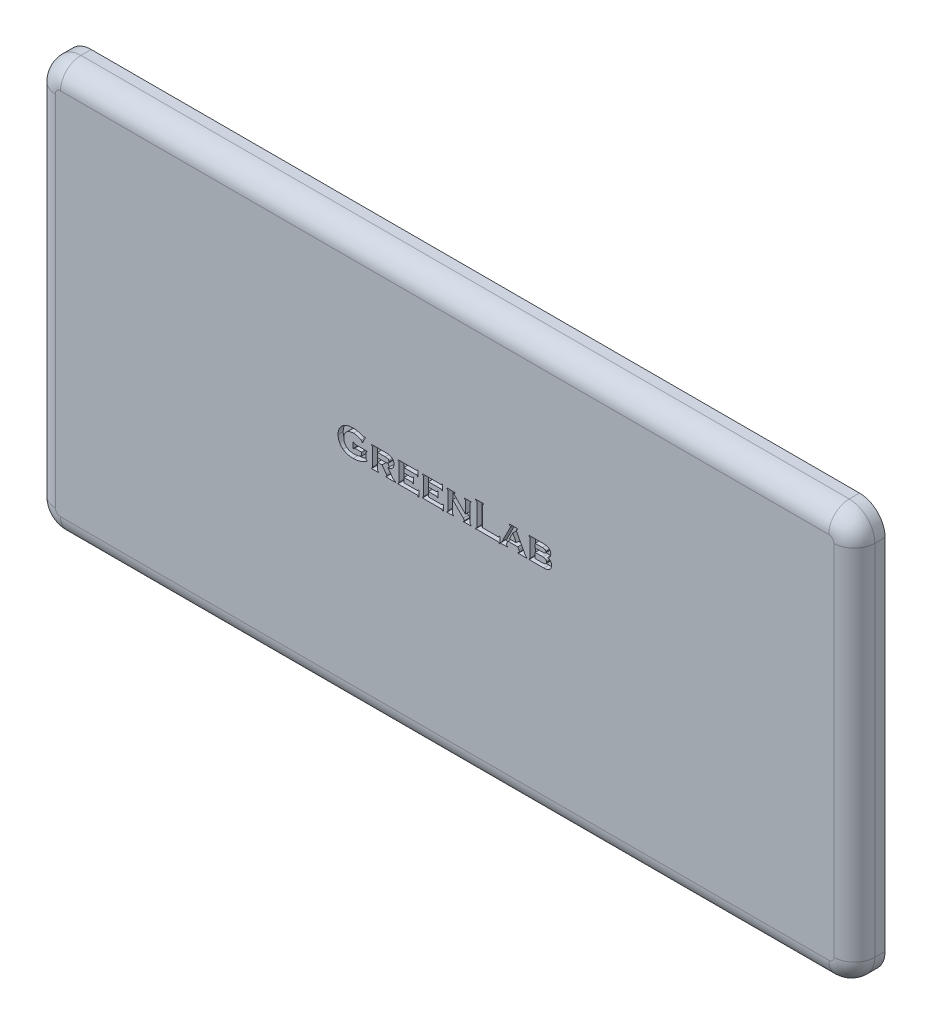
from build123d import *

# Parameters (mm, degrees)
SKETCH1_W           = 80
SKETCH1_H           = 40
BOSS_EXTRUDE1_DEPTH = 3
FILLET1_R           = 2.5
FILLET2_R           = 2
CUT_EXTRUDE1_DEPTH  = 0.5


with BuildPart() as part:
    # Sketch1 → Boss-Extrude1 (new body)
    with BuildSketch(Plane.XY.offset(3)):
        with Locations((17.5, -2.5)):
            Rectangle(SKETCH1_W, SKETCH1_H)
    extrude(amount=-BOSS_EXTRUDE1_DEPTH)

    # Fillet1
    fillet1_edges = [part.edges().sort_by_distance(p)[0] for p in [
        (-22.5, -22.5, 1.5),
        (-22.5, 17.5, 1.5),
        (57.5, 17.5, 1.5),
        (57.5, -22.5, 1.5),
    ]]
    fillet(fillet1_edges, radius=FILLET1_R)

    # Fillet2
    fillet2_edges = [part.edges().sort_by_distance(p)[0] for p in [
        (17.5, 17.5, 3),
        (17.5, -22.5, 3),
        (57.5, -2.5, 3),
        (-22.5, -2.5, 3),
        (56.767766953, -21.767766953, 3),
        (-21.767766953, -21.767766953, 3),
        (56.767766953, 16.767766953, 3),
        (-21.767766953, 16.767766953, 3),
    ]]
    fillet(fillet2_edges, radius=FILLET2_R)

    # Sketch2 → Cut-Extrude1 (cut)
    # profile 1 of 8: a face of its own
    with BuildSketch(Plane.XY.offset(3)):
        with BuildLine():
            Line((9.392361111, -0.347222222), (8.763020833, -0.347222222))
            add(Edge.make_bspline(
                [(8.763020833, -0.347222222), (8.753980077, -0.347634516), (8.736897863, -0.34841353), (8.712652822, -0.35149615), (8.692508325, -0.359463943), (8.675040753, -0.369292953), (8.661109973, -0.38393915), (8.648530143, -0.402230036), (8.637222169, -0.425071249), (8.63150657, -0.442262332), (8.628472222, -0.451388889)],
                knots=[0, 0, 0, 0, 1.161951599, 2.195469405, 3.113157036, 3.92473158, 4.744880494, 5.677977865, 6.767264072, 8, 8, 8, 8], degree=3))
            Line((8.628472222, -0.451388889), (8.559027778, -0.451388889))
            Line((8.559027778, -0.451388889), (8.559027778, 0.104166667))
            Line((8.559027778, 0.104166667), (8.628472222, 0.104166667))
            add(Edge.make_bspline(
                [(8.628472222, 0.104166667), (8.631455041, 0.094831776), (8.63702767, 0.077391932), (8.648829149, 0.054602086), (8.66035132, 0.03555398), (8.674333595, 0.021148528), (8.691430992, 0.011661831), (8.711127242, 0.00441836), (8.734709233, 0.001141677), (8.75144255, 0.000395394), (8.76030816, 0)],
                knots=[0, 0, 0, 0, 1.267174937, 2.367390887, 3.316236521, 4.144614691, 4.932227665, 5.829021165, 6.8497767, 8, 8, 8, 8], degree=3))
            Line((8.76030816, 0), (9.947916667, 0))
            Line((9.947916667, 0), (9.947916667, -0.069444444))
            add(Edge.make_bspline(
                [(9.947916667, -0.069444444), (9.938958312, -0.072276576), (9.922120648, -0.077599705), (9.899742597, -0.088767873), (9.881037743, -0.100221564), (9.866701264, -0.113946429), (9.855806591, -0.129700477), (9.849088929, -0.14859326), (9.844582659, -0.170325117), (9.844040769, -0.185880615), (9.84375, -0.194227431)],
                knots=[0, 0, 0, 0, 1.261989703, 2.371971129, 3.357346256, 4.200586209, 5.023932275, 5.909634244, 6.878345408, 8, 8, 8, 8], degree=3))
            Line((9.84375, -0.194227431), (9.84375, -0.673828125))
            add(Edge.make_bspline(
                [(9.84375, -0.673828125), (9.844110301, -0.682161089), (9.844780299, -0.697656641), (9.848455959, -0.719691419), (9.855267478, -0.738581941), (9.865562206, -0.754788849), (9.879855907, -0.76839035), (9.898945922, -0.779314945), (9.921581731, -0.790471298), (9.938775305, -0.795785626), (9.947916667, -0.798611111)],
                knots=[0, 0, 0, 0, 1.116533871, 2.076248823, 2.980572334, 3.786808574, 4.626198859, 5.59413096, 6.720864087, 8, 8, 8, 8], degree=3))
            Line((9.947916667, -0.798611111), (9.947916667, -0.868055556))
            add(Edge.make_bspline(
                [(9.947916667, -0.868055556), (9.889333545, -0.901306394), (9.774179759, -0.966665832), (9.597911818, -1.051148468), (9.4231664, -1.123083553), (9.249782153, -1.181933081), (9.077820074, -1.22792273), (8.907208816, -1.26040836), (8.737842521, -1.280912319), (8.625273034, -1.283457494), (8.569335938, -1.284722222)],
                knots=[0, 0, 0, 0, 1.109239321, 2.180373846, 3.216973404, 4.220153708, 5.194106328, 6.146335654, 7.078892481, 8, 8, 8, 8], degree=3))
            add(Edge.make_bspline(
                [(8.569335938, -1.284722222), (8.519929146, -1.283992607), (8.423451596, -1.282567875), (8.282287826, -1.26841923), (8.147967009, -1.246781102), (8.020801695, -1.214926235), (7.899922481, -1.175751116), (7.786620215, -1.12610841), (7.679736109, -1.068197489), (7.614070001, -1.022231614), (7.581380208, -0.999348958)],
                knots=[0, 0, 0, 0, 1.133031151, 2.212490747, 3.251195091, 4.25132316, 5.216867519, 6.162529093, 7.085273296, 8, 8, 8, 8], degree=3))
            add(Edge.make_bspline(
                [(7.581380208, -0.999348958), (7.561875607, -0.984168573), (7.523156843, -0.954033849), (7.468372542, -0.905928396), (7.417838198, -0.855026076), (7.370449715, -0.802718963), (7.32740661, -0.747401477), (7.288026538, -0.690094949), (7.251828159, -0.630940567), (7.220575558, -0.569179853), (7.19202152, -0.505624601), (7.167821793, -0.439559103), (7.147270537, -0.371389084), (7.129525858, -0.301271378), (7.116815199, -0.228693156), (7.107739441, -0.153891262), (7.101320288, -0.077151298), (7.100904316, -0.025150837), (7.100694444, 0.001085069)],
                knots=[0, 0, 0, 0, 1.027594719, 2.039887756, 3.02889878, 4.008719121, 4.97294883, 5.940778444, 6.898978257, 7.854104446, 8.816896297, 9.794723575, 10.777166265, 11.776613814, 12.800294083, 13.838400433, 14.909403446, 16, 16, 16, 16], degree=3))
            add(Edge.make_bspline(
                [(7.100694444, 0.001085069), (7.101836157, 0.049624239), (7.104066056, 0.144426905), (7.124688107, 0.2828534), (7.158277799, 0.41361329), (7.204809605, 0.537141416), (7.265875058, 0.652470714), (7.339325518, 0.760529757), (7.426804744, 0.860943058), (7.494039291, 0.919974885), (7.528211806, 0.949978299)],
                knots=[0, 0, 0, 0, 1.080618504, 2.110574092, 3.109061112, 4.08310081, 5.043468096, 6.008781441, 6.987946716, 8, 8, 8, 8], degree=3))
            add(Edge.make_bspline(
                [(7.528211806, 0.949978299), (7.562730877, 0.977010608), (7.632080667, 1.031319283), (7.747213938, 1.098570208), (7.869864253, 1.156516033), (8.001041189, 1.203687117), (8.140572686, 1.239848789), (8.288247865, 1.265688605), (8.444201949, 1.281667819), (8.551031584, 1.28368846), (8.605685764, 1.284722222)],
                knots=[0, 0, 0, 0, 0.913103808, 1.834451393, 2.772129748, 3.738097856, 4.735733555, 5.773315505, 6.860825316, 8, 8, 8, 8], degree=3))
            add(Edge.make_bspline(
                [(8.605685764, 1.284722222), (8.640778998, 1.284112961), (8.709950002, 1.282912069), (8.812133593, 1.276048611), (8.911161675, 1.263397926), (9.008994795, 1.245834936), (9.108495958, 1.221898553), (9.213103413, 1.191809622), (9.324018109, 1.154967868), (9.399514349, 1.126398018), (9.438476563, 1.111653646)],
                knots=[0, 0, 0, 0, 0.983904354, 1.939338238, 2.869415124, 3.781350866, 4.72455948, 5.737149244, 6.832184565, 8, 8, 8, 8], degree=3))
            add(Edge.make_bspline(
                [(9.438476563, 1.111653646), (9.457578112, 1.104222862), (9.492621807, 1.090590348), (9.541236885, 1.074748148), (9.581117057, 1.064487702), (9.604995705, 1.062571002), (9.615342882, 1.061740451)],
                knots=[0, 0, 0, 0, 1.33242011, 2.444457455, 3.325947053, 4, 4, 4, 4], degree=3))
            add(Edge.make_bspline(
                [(9.615342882, 1.061740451), (9.62210386, 1.062329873), (9.636600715, 1.063593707), (9.658314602, 1.072586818), (9.681605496, 1.085933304), (9.696688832, 1.097688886), (9.704861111, 1.10405816)],
                knots=[0, 0, 0, 0, 0.80452628, 1.72506123, 2.767418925, 4, 4, 4, 4], degree=3))
            Line((9.704861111, 1.10405816), (9.774305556, 1.076388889))
            Line((9.774305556, 1.076388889), (9.479166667, 0.477430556))
            Line((9.479166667, 0.477430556), (9.425998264, 0.505642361))
            add(Edge.make_bspline(
                [(9.425998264, 0.505642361), (9.425696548, 0.515250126), (9.425141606, 0.53292155), (9.420973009, 0.557160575), (9.416515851, 0.577292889), (9.409832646, 0.594498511), (9.398649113, 0.609467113), (9.384749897, 0.625852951), (9.365336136, 0.64292875), (9.350816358, 0.654545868), (9.342990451, 0.660807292)],
                knots=[0, 0, 0, 0, 1.244331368, 2.288680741, 3.181265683, 3.916936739, 4.658188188, 5.588746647, 6.700376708, 8, 8, 8, 8], degree=3))
            add(Edge.make_bspline(
                [(9.342990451, 0.660807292), (9.322295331, 0.675012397), (9.278307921, 0.705205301), (9.201774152, 0.743529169), (9.112004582, 0.777376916), (9.012385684, 0.808613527), (8.907875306, 0.834707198), (8.803510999, 0.853755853), (8.70199497, 0.865740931), (8.635194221, 0.867293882), (8.602430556, 0.868055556)],
                knots=[0, 0, 0, 0, 0.772448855, 1.64183753, 2.627606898, 3.725128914, 4.855858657, 5.942928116, 6.991070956, 8, 8, 8, 8], degree=3))
            add(Edge.make_bspline(
                [(8.602430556, 0.868055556), (8.570210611, 0.867506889), (8.507224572, 0.866434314), (8.414688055, 0.855766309), (8.326500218, 0.838592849), (8.242201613, 0.814661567), (8.162425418, 0.783836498), (8.086855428, 0.7458094), (8.014859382, 0.701918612), (7.971099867, 0.666554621), (7.94921875, 0.648871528)],
                knots=[0, 0, 0, 0, 1.098368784, 2.14717621, 3.171603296, 4.15934231, 5.131674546, 6.083189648, 7.041535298, 8, 8, 8, 8], degree=3))
            add(Edge.make_bspline(
                [(7.94921875, 0.648871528), (7.925714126, 0.62788857), (7.879504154, 0.58663618), (7.820080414, 0.516055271), (7.769439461, 0.441157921), (7.727678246, 0.361166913), (7.695598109, 0.276060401), (7.67312424, 0.185921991), (7.658299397, 0.09109294), (7.656942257, 0.026099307), (7.65625, -0.007052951)],
                knots=[0, 0, 0, 0, 1.016795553, 1.999014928, 2.971244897, 3.932867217, 4.907271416, 5.901990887, 6.92983762, 8, 8, 8, 8], degree=3))
            add(Edge.make_bspline(
                [(7.65625, -0.007052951), (7.656972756, -0.039300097), (7.65838448, -0.102286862), (7.672712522, -0.194381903), (7.694337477, -0.281931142), (7.726437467, -0.364534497), (7.766391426, -0.442507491), (7.816216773, -0.515299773), (7.87386815, -0.584302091), (7.919197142, -0.624636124), (7.942165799, -0.645073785)],
                knots=[0, 0, 0, 0, 1.069643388, 2.089281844, 3.086639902, 4.057689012, 5.02427436, 5.988321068, 6.980662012, 8, 8, 8, 8], degree=3))
            add(Edge.make_bspline(
                [(7.942165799, -0.645073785), (7.964434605, -0.66289434), (8.009168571, -0.698692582), (8.082803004, -0.744305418), (8.161999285, -0.782097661), (8.245783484, -0.813760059), (8.33478101, -0.838245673), (8.429033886, -0.855186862), (8.528366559, -0.866595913), (8.596429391, -0.867562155), (8.631184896, -0.868055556)],
                knots=[0, 0, 0, 0, 0.924808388, 1.857771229, 2.80254234, 3.768129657, 4.760342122, 5.792672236, 6.872853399, 8, 8, 8, 8], degree=3))
            add(Edge.make_bspline(
                [(8.631184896, -0.868055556), (8.665740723, -0.867328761), (8.734776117, -0.865876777), (8.838102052, -0.857261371), (8.940531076, -0.841751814), (9.041488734, -0.821473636), (9.138598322, -0.795732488), (9.230099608, -0.765568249), (9.314450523, -0.730503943), (9.366864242, -0.702960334), (9.392361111, -0.689561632)],
                knots=[0, 0, 0, 0, 1.05048524, 2.098652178, 3.148964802, 4.19795309, 5.227341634, 6.200829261, 7.124785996, 8, 8, 8, 8], degree=3))
            Line((9.392361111, -0.689561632), (9.392361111, -0.347222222))
        make_face()
    # profile 2 of 8: a face of its own
    with BuildSketch(Plane.XY.offset(3)):
        with BuildLine():
            Line((10.954861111, -0.416666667), (10.954861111, -1.048177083))
            add(Edge.make_bspline(
                [(10.954861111, -1.048177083), (10.955160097, -1.0568801), (10.955718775, -1.073142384), (10.960153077, -1.095995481), (10.967061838, -1.115684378), (10.976966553, -1.132897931), (10.991774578, -1.146977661), (11.010052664, -1.159747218), (11.032919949, -1.171315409), (11.049903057, -1.177326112), (11.059027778, -1.180555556)],
                knots=[0, 0, 0, 0, 1.132768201, 2.116668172, 3.018181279, 3.842213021, 4.674950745, 5.655178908, 6.740169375, 8, 8, 8, 8], degree=3))
            Line((11.059027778, -1.180555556), (11.059027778, -1.25))
            Line((11.059027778, -1.25), (10.364583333, -1.25))
            Line((10.364583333, -1.25), (10.364583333, -1.180555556))
            add(Edge.make_bspline(
                [(10.364583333, -1.180555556), (10.373527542, -1.177700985), (10.390338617, -1.172335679), (10.412846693, -1.161465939), (10.431179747, -1.149034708), (10.44552045, -1.134320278), (10.456004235, -1.116821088), (10.463583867, -1.09662627), (10.467845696, -1.073126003), (10.468435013, -1.056513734), (10.46875, -1.047634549)],
                knots=[0, 0, 0, 0, 1.214843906, 2.283358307, 3.225537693, 4.070394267, 4.922042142, 5.848661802, 6.850119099, 8, 8, 8, 8], degree=3))
            Line((10.46875, -1.047634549), (10.46875, 0.59624566))
            add(Edge.make_bspline(
                [(10.46875, 0.59624566), (10.468319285, 0.604919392), (10.467498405, 0.621450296), (10.464620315, 0.64488467), (10.45623523, 0.664293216), (10.44672628, 0.681553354), (10.431864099, 0.6953932), (10.413956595, 0.708696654), (10.390768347, 0.719741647), (10.373681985, 0.725891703), (10.364583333, 0.729166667)],
                knots=[0, 0, 0, 0, 1.128472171, 2.1507081, 3.035212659, 3.856119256, 4.685698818, 5.643135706, 6.74494729, 8, 8, 8, 8], degree=3))
            Line((10.364583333, 0.729166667), (10.364583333, 0.798611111))
            Line((10.364583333, 0.798611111), (11.694878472, 0.798611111))
            add(Edge.make_bspline(
                [(11.694878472, 0.798611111), (11.735571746, 0.798319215), (11.811747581, 0.797772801), (11.918395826, 0.793316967), (12.009437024, 0.784663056), (12.08734479, 0.773630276), (12.155785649, 0.757407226), (12.218709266, 0.736400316), (12.278069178, 0.7097724), (12.314661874, 0.687594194), (12.332899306, 0.676540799)],
                knots=[0, 0, 0, 0, 1.48188809, 2.77402262, 3.885406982, 4.811191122, 5.637019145, 6.442966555, 7.223990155, 8, 8, 8, 8], degree=3))
            add(Edge.make_bspline(
                [(12.332899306, 0.676540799), (12.350487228, 0.664205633), (12.385272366, 0.639809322), (12.430084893, 0.594520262), (12.467690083, 0.543526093), (12.498940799, 0.487256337), (12.522781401, 0.425103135), (12.540108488, 0.357414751), (12.550472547, 0.283885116), (12.551535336, 0.232962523), (12.552083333, 0.206705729)],
                knots=[0, 0, 0, 0, 0.949876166, 1.878651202, 2.806113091, 3.748939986, 4.72015234, 5.745812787, 6.837692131, 8, 8, 8, 8], degree=3))
            add(Edge.make_bspline(
                [(12.552083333, 0.206705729), (12.551684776, 0.186614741), (12.550906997, 0.147407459), (12.544326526, 0.090219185), (12.533431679, 0.036559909), (12.51909248, -0.014020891), (12.499164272, -0.060657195), (12.476016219, -0.104677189), (12.447609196, -0.144664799), (12.415166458, -0.181705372), (12.377765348, -0.215345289), (12.335796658, -0.247287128), (12.287981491, -0.27549296), (12.235286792, -0.301929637), (12.177276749, -0.325390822), (12.11417691, -0.347290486), (12.045600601, -0.366137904), (11.997846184, -0.376563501), (11.973198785, -0.381944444)],
                knots=[0, 0, 0, 0, 1.054974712, 2.05876829, 3.018077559, 3.928757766, 4.81427522, 5.67693176, 6.535972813, 7.383915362, 8.257948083, 9.17356801, 10.149288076, 11.168732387, 12.267602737, 13.433048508, 14.67512408, 16, 16, 16, 16], degree=3))
            Line((11.973198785, -0.381944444), (12.370334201, -0.917426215))
            add(Edge.make_bspline(
                [(12.370334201, -0.917426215), (12.387300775, -0.939841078), (12.418678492, -0.981294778), (12.464977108, -1.036046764), (12.504847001, -1.08021234), (12.541186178, -1.113682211), (12.57618919, -1.139052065), (12.612763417, -1.157179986), (12.650608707, -1.172659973), (12.67746429, -1.177913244), (12.690972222, -1.180555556)],
                knots=[0, 0, 0, 0, 1.583031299, 2.927633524, 4.037651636, 4.931799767, 5.706188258, 6.462410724, 7.226616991, 8, 8, 8, 8], degree=3))
            Line((12.690972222, -1.180555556), (12.690972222, -1.25))
            Line((12.690972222, -1.25), (11.765950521, -1.25))
            Line((11.765950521, -1.25), (11.765950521, -1.180555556))
            add(Edge.make_bspline(
                [(11.765950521, -1.180555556), (11.780734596, -1.17654565), (11.80718336, -1.169371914), (11.838745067, -1.150741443), (11.86184701, -1.128847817), (11.86413658, -1.110258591), (11.865234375, -1.101345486)],
                knots=[0, 0, 0, 0, 1.339679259, 2.396691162, 3.231250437, 4, 4, 4, 4], degree=3))
            add(Edge.make_bspline(
                [(11.865234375, -1.101345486), (11.864335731, -1.093828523), (11.862256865, -1.076439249), (11.84855287, -1.049381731), (11.829060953, -1.017140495), (11.811813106, -0.995183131), (11.802300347, -0.983072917)],
                knots=[0, 0, 0, 0, 0.664601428, 1.537447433, 2.641820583, 4, 4, 4, 4], degree=3))
            Line((11.802300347, -0.983072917), (11.393771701, -0.416666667))
            Line((11.393771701, -0.416666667), (10.954861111, -0.416666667))
        make_face()
        with BuildLine():
            Line((10.954861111, -0.034722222), (11.700303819, -0.034722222))
            add(Edge.make_bspline(
                [(11.700303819, -0.034722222), (11.726739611, -0.03447032), (11.776102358, -0.033999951), (11.84451607, -0.026461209), (11.902715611, -0.017240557), (11.936258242, -0.004639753), (11.951497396, 0.001085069)],
                knots=[0, 0, 0, 0, 1.241949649, 2.3190547, 3.236309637, 4, 4, 4, 4], degree=3))
            add(Edge.make_bspline(
                [(11.951497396, 0.001085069), (11.960508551, 0.005346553), (11.978108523, 0.013669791), (12.001525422, 0.030318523), (12.022401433, 0.049152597), (12.037699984, 0.072530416), (12.050635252, 0.097897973), (12.05972827, 0.126259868), (12.06528008, 0.157659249), (12.065734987, 0.179554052), (12.065972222, 0.190972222)],
                knots=[0, 0, 0, 0, 1.008207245, 1.969161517, 2.902631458, 3.838078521, 4.780680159, 5.783374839, 6.844026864, 8, 8, 8, 8], degree=3))
            add(Edge.make_bspline(
                [(12.065972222, 0.190972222), (12.065250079, 0.210628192), (12.063899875, 0.247379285), (12.048480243, 0.297767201), (12.023062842, 0.339090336), (11.992001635, 0.363978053), (11.963064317, 0.379536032), (11.936833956, 0.389166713), (11.907139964, 0.397832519), (11.873206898, 0.404791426), (11.835509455, 0.410086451), (11.793848, 0.413651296), (11.748452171, 0.416703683), (11.716766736, 0.416679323), (11.700303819, 0.416666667)],
                knots=[0, 0, 0, 0, 1.425592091, 2.665453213, 3.789359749, 4.900959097, 5.513024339, 6.175067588, 6.928547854, 7.761851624, 8.692003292, 9.695964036, 10.802883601, 12, 12, 12, 12], degree=3))
            Line((11.700303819, 0.416666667), (10.954861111, 0.416666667))
            Line((10.954861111, 0.416666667), (10.954861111, -0.034722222))
        make_face(mode=Mode.SUBTRACT)
    # profile 3 of 8: a face of its own
    with BuildSketch(Plane.XY.offset(3)):
        with BuildLine():
            Line((13.524305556, -0.416666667), (13.524305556, -0.868055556))
            Line((13.524305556, -0.868055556), (14.782443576, -0.868055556))
            add(Edge.make_bspline(
                [(14.782443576, -0.868055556), (14.791136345, -0.867687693), (14.807346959, -0.867001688), (14.830293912, -0.863422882), (14.849896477, -0.856551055), (14.866680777, -0.846130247), (14.881299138, -0.832059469), (14.893550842, -0.813190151), (14.90434504, -0.790085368), (14.910116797, -0.772999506), (14.913194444, -0.763888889)],
                knots=[0, 0, 0, 0, 1.135380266, 2.11730133, 3.020893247, 3.826673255, 4.678188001, 5.647254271, 6.745456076, 8, 8, 8, 8], degree=3))
            Line((14.913194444, -0.763888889), (14.982638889, -0.763888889))
            Line((14.982638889, -0.763888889), (14.982638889, -1.354166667))
            Line((14.982638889, -1.354166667), (14.913194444, -1.354166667))
            add(Edge.make_bspline(
                [(14.913194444, -1.354166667), (14.910565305, -1.345206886), (14.905609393, -1.328317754), (14.894616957, -1.305919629), (14.882236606, -1.287544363), (14.867562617, -1.273417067), (14.850467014, -1.262584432), (14.830330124, -1.255198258), (14.80703442, -1.250928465), (14.790600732, -1.25032138), (14.781901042, -1.25)],
                knots=[0, 0, 0, 0, 1.215074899, 2.290408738, 3.23860127, 4.08884986, 4.925925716, 5.858459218, 6.866307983, 8, 8, 8, 8], degree=3))
            Line((14.781901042, -1.25), (12.934027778, -1.25))
            Line((12.934027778, -1.25), (12.934027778, -1.180555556))
            add(Edge.make_bspline(
                [(12.934027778, -1.180555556), (12.942971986, -1.177700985), (12.959783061, -1.172335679), (12.982291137, -1.161465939), (13.000624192, -1.149034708), (13.014964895, -1.134320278), (13.025448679, -1.116821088), (13.033028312, -1.09662627), (13.03729014, -1.073126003), (13.037879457, -1.056513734), (13.038194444, -1.047634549)],
                knots=[0, 0, 0, 0, 1.214843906, 2.283358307, 3.225537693, 4.070394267, 4.922042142, 5.848661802, 6.850119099, 8, 8, 8, 8], degree=3))
            Line((13.038194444, -1.047634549), (13.038194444, 0.59624566))
            add(Edge.make_bspline(
                [(13.038194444, 0.59624566), (13.03776373, 0.604919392), (13.036942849, 0.621450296), (13.03406476, 0.64488467), (13.025679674, 0.664293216), (13.016170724, 0.681553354), (13.001308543, 0.6953932), (12.983401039, 0.708696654), (12.960212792, 0.719741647), (12.943126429, 0.725891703), (12.934027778, 0.729166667)],
                knots=[0, 0, 0, 0, 1.128472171, 2.1507081, 3.035212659, 3.856119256, 4.685698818, 5.643135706, 6.74494729, 8, 8, 8, 8], degree=3))
            Line((12.934027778, 0.729166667), (12.934027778, 0.798611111))
            Line((12.934027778, 0.798611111), (14.711914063, 0.798611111))
            add(Edge.make_bspline(
                [(14.711914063, 0.798611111), (14.720796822, 0.798915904), (14.737415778, 0.799486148), (14.760642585, 0.803830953), (14.780541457, 0.810782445), (14.797709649, 0.82090019), (14.812401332, 0.835164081), (14.824478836, 0.853912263), (14.835671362, 0.87660099), (14.840929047, 0.893637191), (14.84375, 0.902777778)],
                knots=[0, 0, 0, 0, 1.152879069, 2.156947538, 3.05581166, 3.877422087, 4.724481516, 5.688477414, 6.75977783, 8, 8, 8, 8], degree=3))
            Line((14.84375, 0.902777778), (14.913194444, 0.902777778))
            Line((14.913194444, 0.902777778), (14.913194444, 0.3125))
            Line((14.913194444, 0.3125), (14.84375, 0.3125))
            add(Edge.make_bspline(
                [(14.84375, 0.3125), (14.840884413, 0.321616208), (14.835494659, 0.338762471), (14.824809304, 0.361749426), (14.812200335, 0.380142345), (14.797753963, 0.394458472), (14.780539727, 0.404186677), (14.761084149, 0.412525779), (14.737664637, 0.415418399), (14.7211315, 0.416237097), (14.712456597, 0.416666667)],
                knots=[0, 0, 0, 0, 1.242738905, 2.33741155, 3.283964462, 4.132742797, 4.956020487, 5.843079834, 6.86826837, 8, 8, 8, 8], degree=3))
            Line((14.712456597, 0.416666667), (13.524305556, 0.416666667))
            Line((13.524305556, 0.416666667), (13.524305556, -0.034722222))
            Line((13.524305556, -0.034722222), (14.261610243, -0.034722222))
            add(Edge.make_bspline(
                [(14.261610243, -0.034722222), (14.270131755, -0.034409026), (14.286211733, -0.03381803), (14.308716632, -0.029499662), (14.3281166, -0.022577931), (14.344755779, -0.012251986), (14.359418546, 0.001797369), (14.371412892, 0.020705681), (14.383179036, 0.043291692), (14.389151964, 0.060304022), (14.392361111, 0.069444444)],
                knots=[0, 0, 0, 0, 1.117968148, 2.109590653, 2.995889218, 3.806125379, 4.662349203, 5.636774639, 6.730281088, 8, 8, 8, 8], degree=3))
            Line((14.392361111, 0.069444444), (14.461805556, 0.069444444))
            Line((14.461805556, 0.069444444), (14.461805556, -0.520833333))
            Line((14.461805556, -0.520833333), (14.392361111, -0.520833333))
            add(Edge.make_bspline(
                [(14.392361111, -0.520833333), (14.389515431, -0.511883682), (14.384166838, -0.495062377), (14.373121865, -0.472486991), (14.361003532, -0.453937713), (14.346696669, -0.439395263), (14.329976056, -0.428894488), (14.310016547, -0.421727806), (14.286914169, -0.417643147), (14.270307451, -0.417002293), (14.261610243, -0.416666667)],
                knots=[0, 0, 0, 0, 1.225527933, 2.303439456, 3.273384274, 4.108798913, 4.947881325, 5.830104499, 6.863590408, 8, 8, 8, 8], degree=3))
            Line((14.261610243, -0.416666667), (13.524305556, -0.416666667))
        make_face()
    # profile 4 of 8: a face of its own
    with BuildSketch(Plane.XY.offset(3)):
        with BuildLine():
            Line((15.920138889, -0.416666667), (15.920138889, -0.868055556))
            Line((15.920138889, -0.868055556), (17.17827691, -0.868055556))
            add(Edge.make_bspline(
                [(17.17827691, -0.868055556), (17.186969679, -0.867687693), (17.203180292, -0.867001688), (17.226127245, -0.863422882), (17.24572981, -0.856551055), (17.26251411, -0.846130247), (17.277132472, -0.832059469), (17.289384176, -0.813190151), (17.300178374, -0.790085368), (17.30595013, -0.772999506), (17.309027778, -0.763888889)],
                knots=[0, 0, 0, 0, 1.135380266, 2.11730133, 3.020893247, 3.826673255, 4.678188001, 5.647254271, 6.745456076, 8, 8, 8, 8], degree=3))
            Line((17.309027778, -0.763888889), (17.378472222, -0.763888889))
            Line((17.378472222, -0.763888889), (17.378472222, -1.354166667))
            Line((17.378472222, -1.354166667), (17.309027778, -1.354166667))
            add(Edge.make_bspline(
                [(17.309027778, -1.354166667), (17.306398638, -1.345206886), (17.301442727, -1.328317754), (17.29045029, -1.305919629), (17.27806994, -1.287544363), (17.26339595, -1.273417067), (17.246300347, -1.262584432), (17.226163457, -1.255198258), (17.202867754, -1.250928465), (17.186434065, -1.25032138), (17.177734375, -1.25)],
                knots=[0, 0, 0, 0, 1.215074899, 2.290408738, 3.23860127, 4.08884986, 4.925925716, 5.858459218, 6.866307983, 8, 8, 8, 8], degree=3))
            Line((17.177734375, -1.25), (15.329861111, -1.25))
            Line((15.329861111, -1.25), (15.329861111, -1.180555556))
            add(Edge.make_bspline(
                [(15.329861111, -1.180555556), (15.338805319, -1.177700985), (15.355616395, -1.172335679), (15.378124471, -1.161465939), (15.396457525, -1.149034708), (15.410798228, -1.134320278), (15.421282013, -1.116821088), (15.428861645, -1.09662627), (15.433123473, -1.073126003), (15.43371279, -1.056513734), (15.434027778, -1.047634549)],
                knots=[0, 0, 0, 0, 1.214843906, 2.283358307, 3.225537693, 4.070394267, 4.922042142, 5.848661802, 6.850119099, 8, 8, 8, 8], degree=3))
            Line((15.434027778, -1.047634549), (15.434027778, 0.59624566))
            add(Edge.make_bspline(
                [(15.434027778, 0.59624566), (15.433597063, 0.604919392), (15.432776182, 0.621450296), (15.429898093, 0.64488467), (15.421513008, 0.664293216), (15.412004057, 0.681553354), (15.397141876, 0.6953932), (15.379234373, 0.708696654), (15.356046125, 0.719741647), (15.338959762, 0.725891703), (15.329861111, 0.729166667)],
                knots=[0, 0, 0, 0, 1.128472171, 2.1507081, 3.035212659, 3.856119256, 4.685698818, 5.643135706, 6.74494729, 8, 8, 8, 8], degree=3))
            Line((15.329861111, 0.729166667), (15.329861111, 0.798611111))
            Line((15.329861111, 0.798611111), (17.107747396, 0.798611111))
            add(Edge.make_bspline(
                [(17.107747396, 0.798611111), (17.116630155, 0.798915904), (17.133249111, 0.799486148), (17.156475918, 0.803830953), (17.17637479, 0.810782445), (17.193542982, 0.82090019), (17.208234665, 0.835164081), (17.220312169, 0.853912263), (17.231504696, 0.87660099), (17.23676238, 0.893637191), (17.239583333, 0.902777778)],
                knots=[0, 0, 0, 0, 1.152879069, 2.156947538, 3.05581166, 3.877422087, 4.724481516, 5.688477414, 6.75977783, 8, 8, 8, 8], degree=3))
            Line((17.239583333, 0.902777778), (17.309027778, 0.902777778))
            Line((17.309027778, 0.902777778), (17.309027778, 0.3125))
            Line((17.309027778, 0.3125), (17.239583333, 0.3125))
            add(Edge.make_bspline(
                [(17.239583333, 0.3125), (17.236717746, 0.321616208), (17.231327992, 0.338762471), (17.220642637, 0.361749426), (17.208033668, 0.380142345), (17.193587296, 0.394458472), (17.176373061, 0.404186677), (17.156917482, 0.412525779), (17.13349797, 0.415418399), (17.116964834, 0.416237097), (17.108289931, 0.416666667)],
                knots=[0, 0, 0, 0, 1.242738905, 2.33741155, 3.283964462, 4.132742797, 4.956020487, 5.843079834, 6.86826837, 8, 8, 8, 8], degree=3))
            Line((17.108289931, 0.416666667), (15.920138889, 0.416666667))
            Line((15.920138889, 0.416666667), (15.920138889, -0.034722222))
            Line((15.920138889, -0.034722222), (16.657443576, -0.034722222))
            add(Edge.make_bspline(
                [(16.657443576, -0.034722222), (16.665965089, -0.034409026), (16.682045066, -0.03381803), (16.704549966, -0.029499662), (16.723949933, -0.022577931), (16.740589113, -0.012251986), (16.755251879, 0.001797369), (16.767246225, 0.020705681), (16.779012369, 0.043291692), (16.784985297, 0.060304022), (16.788194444, 0.069444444)],
                knots=[0, 0, 0, 0, 1.117968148, 2.109590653, 2.995889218, 3.806125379, 4.662349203, 5.636774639, 6.730281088, 8, 8, 8, 8], degree=3))
            Line((16.788194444, 0.069444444), (16.857638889, 0.069444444))
            Line((16.857638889, 0.069444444), (16.857638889, -0.520833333))
            Line((16.857638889, -0.520833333), (16.788194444, -0.520833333))
            add(Edge.make_bspline(
                [(16.788194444, -0.520833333), (16.785348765, -0.511883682), (16.780000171, -0.495062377), (16.768955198, -0.472486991), (16.756836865, -0.453937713), (16.742530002, -0.439395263), (16.725809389, -0.428894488), (16.70584988, -0.421727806), (16.682747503, -0.417643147), (16.666140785, -0.417002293), (16.657443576, -0.416666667)],
                knots=[0, 0, 0, 0, 1.225527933, 2.303439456, 3.273384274, 4.108798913, 4.947881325, 5.830104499, 6.863590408, 8, 8, 8, 8], degree=3))
            Line((16.657443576, -0.416666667), (15.920138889, -0.416666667))
        make_face()
    # profile 5 of 8: a face of its own
    with BuildSketch(Plane.XY.offset(3)):
        with BuildLine():
            Line((18.28125, 0.093858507), (18.28125, -1.046006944))
            add(Edge.make_bspline(
                [(18.28125, -1.046006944), (18.281544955, -1.054893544), (18.282096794, -1.071519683), (18.286594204, -1.094867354), (18.293319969, -1.115310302), (18.304126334, -1.132883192), (18.318597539, -1.147818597), (18.337278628, -1.160319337), (18.359595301, -1.171849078), (18.376458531, -1.177535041), (18.385416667, -1.180555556)],
                knots=[0, 0, 0, 0, 1.143670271, 2.139718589, 3.053348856, 3.900396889, 4.773630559, 5.710721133, 6.783882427, 8, 8, 8, 8], degree=3))
            Line((18.385416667, -1.180555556), (18.385416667, -1.25))
            Line((18.385416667, -1.25), (17.725694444, -1.25))
            Line((17.725694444, -1.25), (17.725694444, -1.180555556))
            add(Edge.make_bspline(
                [(17.725694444, -1.180555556), (17.734638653, -1.177700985), (17.751449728, -1.172335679), (17.773957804, -1.161465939), (17.792290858, -1.149034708), (17.806631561, -1.134320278), (17.817115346, -1.116821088), (17.824694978, -1.09662627), (17.828956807, -1.073126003), (17.829546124, -1.056513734), (17.829861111, -1.047634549)],
                knots=[0, 0, 0, 0, 1.214843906, 2.283358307, 3.225537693, 4.070394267, 4.922042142, 5.848661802, 6.850119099, 8, 8, 8, 8], degree=3))
            Line((17.829861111, -1.047634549), (17.829861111, 0.59624566))
            add(Edge.make_bspline(
                [(17.829861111, 0.59624566), (17.829430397, 0.604919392), (17.828609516, 0.621450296), (17.825731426, 0.64488467), (17.817346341, 0.664293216), (17.807837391, 0.681553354), (17.79297521, 0.6953932), (17.775067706, 0.708696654), (17.751879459, 0.719741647), (17.734793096, 0.725891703), (17.725694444, 0.729166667)],
                knots=[0, 0, 0, 0, 1.128472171, 2.1507081, 3.035212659, 3.856119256, 4.685698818, 5.643135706, 6.74494729, 8, 8, 8, 8], degree=3))
            Line((17.725694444, 0.729166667), (17.725694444, 0.798611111))
            Line((17.725694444, 0.798611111), (18.496636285, 0.798611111))
            Line((18.496636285, 0.798611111), (18.496636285, 0.729166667))
            add(Edge.make_bspline(
                [(18.496636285, 0.729166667), (18.484845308, 0.725709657), (18.463820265, 0.719545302), (18.437700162, 0.7041957), (18.420119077, 0.683665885), (18.418312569, 0.667239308), (18.417426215, 0.659179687)],
                knots=[0, 0, 0, 0, 1.287745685, 2.296239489, 3.164058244, 4, 4, 4, 4], degree=3))
            add(Edge.make_bspline(
                [(18.417426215, 0.659179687), (18.418315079, 0.651664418), (18.420256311, 0.635251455), (18.43229719, 0.610676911), (18.450467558, 0.584452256), (18.466344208, 0.567813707), (18.474934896, 0.558810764)],
                knots=[0, 0, 0, 0, 0.763994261, 1.668524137, 2.738463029, 4, 4, 4, 4], degree=3))
            Line((18.474934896, 0.558810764), (19.53125, -0.511067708))
            Line((19.53125, -0.511067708), (19.53125, 0.59624566))
            add(Edge.make_bspline(
                [(19.53125, 0.59624566), (19.530829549, 0.604923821), (19.530028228, 0.621463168), (19.526998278, 0.64500946), (19.51890068, 0.664736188), (19.509048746, 0.682110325), (19.494569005, 0.696484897), (19.476542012, 0.709812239), (19.453219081, 0.720234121), (19.436172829, 0.726060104), (19.427083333, 0.729166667)],
                knots=[0, 0, 0, 0, 1.125637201, 2.145305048, 3.049360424, 3.868204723, 4.712412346, 5.667443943, 6.756221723, 8, 8, 8, 8], degree=3))
            Line((19.427083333, 0.729166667), (19.427083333, 0.798611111))
            Line((19.427083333, 0.798611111), (20.086805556, 0.798611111))
            Line((20.086805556, 0.798611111), (20.086805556, 0.729166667))
            add(Edge.make_bspline(
                [(20.086805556, 0.729166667), (20.07769139, 0.72610474), (20.060753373, 0.720414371), (20.037736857, 0.709479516), (20.0193493, 0.696682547), (20.004906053, 0.682071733), (19.994821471, 0.664863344), (19.987774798, 0.644812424), (19.983602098, 0.62155179), (19.982969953, 0.604943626), (19.982638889, 0.59624566)],
                knots=[0, 0, 0, 0, 1.244751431, 2.313280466, 3.288100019, 4.132968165, 4.952453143, 5.848991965, 6.873482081, 8, 8, 8, 8], degree=3))
            Line((19.982638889, 0.59624566), (19.982638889, -1.046006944))
            add(Edge.make_bspline(
                [(19.982638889, -1.046006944), (19.982973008, -1.054703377), (19.983610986, -1.071308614), (19.987744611, -1.094588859), (19.994968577, -1.11472442), (20.004745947, -1.132265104), (20.019189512, -1.147071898), (20.038193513, -1.158984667), (20.060488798, -1.171512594), (20.077635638, -1.17740459), (20.086805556, -1.180555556)],
                knots=[0, 0, 0, 0, 1.1214246, 2.141282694, 3.033768, 3.869628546, 4.710676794, 5.667831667, 6.752785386, 8, 8, 8, 8], degree=3))
            Line((20.086805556, -1.180555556), (20.086805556, -1.25))
            Line((20.086805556, -1.25), (19.368489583, -1.25))
            Line((19.368489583, -1.25), (19.368489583, -1.180555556))
            add(Edge.make_bspline(
                [(19.368489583, -1.180555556), (19.380040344, -1.177588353), (19.400866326, -1.172238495), (19.427214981, -1.158685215), (19.444467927, -1.138616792), (19.446263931, -1.1227832), (19.447157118, -1.114908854)],
                knots=[0, 0, 0, 0, 1.28387963, 2.314830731, 3.161933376, 4, 4, 4, 4], degree=3))
            add(Edge.make_bspline(
                [(19.447157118, -1.114908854), (19.445977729, -1.106177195), (19.443409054, -1.087159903), (19.427434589, -1.0653674), (19.409411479, -1.044070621), (19.388236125, -1.021008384), (19.360370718, -0.991393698), (19.339075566, -0.969993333), (19.327256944, -0.958116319)],
                knots=[0, 0, 0, 0, 0.779058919, 1.696767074, 2.352735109, 3.293916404, 4.498147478, 6, 6, 6, 6], degree=3))
            Line((19.327256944, -0.958116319), (18.28125, 0.093858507))
        make_face()
    # profile 6 of 8: a face of its own
    with BuildSketch(Plane.XY.offset(3)):
        with BuildLine():
            Line((21.197916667, -0.833333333), (22.699110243, -0.833333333))
            add(Edge.make_bspline(
                [(22.699110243, -0.833333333), (22.707807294, -0.833008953), (22.724235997, -0.832396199), (22.747167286, -0.828236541), (22.766753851, -0.820996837), (22.783813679, -0.811225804), (22.79792818, -0.796557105), (22.8101063, -0.778076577), (22.821143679, -0.755239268), (22.826811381, -0.738287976), (22.829861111, -0.729166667)],
                knots=[0, 0, 0, 0, 1.13718709, 2.148142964, 3.030969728, 3.85821599, 4.694202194, 5.66481062, 6.743459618, 8, 8, 8, 8], degree=3))
            Line((22.829861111, -0.729166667), (22.899305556, -0.729166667))
            Line((22.899305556, -0.729166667), (22.899305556, -1.354166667))
            Line((22.899305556, -1.354166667), (22.829861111, -1.354166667))
            add(Edge.make_bspline(
                [(22.829861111, -1.354166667), (22.826766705, -1.345069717), (22.820963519, -1.328009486), (22.81043664, -1.304873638), (22.797733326, -1.286739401), (22.783852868, -1.272040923), (22.766621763, -1.262509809), (22.747204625, -1.254131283), (22.723772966, -1.251251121), (22.707241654, -1.250430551), (22.698567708, -1.25)],
                knots=[0, 0, 0, 0, 1.251925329, 2.347834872, 3.295457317, 4.12837309, 4.952581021, 5.840642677, 6.866989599, 8, 8, 8, 8], degree=3))
            Line((22.698567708, -1.25), (20.538194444, -1.25))
            Line((20.538194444, -1.25), (20.538194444, -1.180555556))
            add(Edge.make_bspline(
                [(20.538194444, -1.180555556), (20.547291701, -1.177461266), (20.564352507, -1.171658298), (20.587484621, -1.161130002), (20.605630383, -1.14843106), (20.620292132, -1.13453667), (20.630125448, -1.117060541), (20.637923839, -1.097248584), (20.641240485, -1.073593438), (20.641970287, -1.057041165), (20.642361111, -1.048177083)],
                knots=[0, 0, 0, 0, 1.245049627, 2.334940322, 3.277358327, 4.105699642, 4.925380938, 5.852235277, 6.849827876, 8, 8, 8, 8], degree=3))
            Line((20.642361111, -1.048177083), (20.642361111, 1.048177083))
            add(Edge.make_bspline(
                [(20.642361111, 1.048177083), (20.641962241, 1.057038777), (20.641217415, 1.073586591), (20.638022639, 1.097102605), (20.630021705, 1.116676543), (20.620138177, 1.134012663), (20.605839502, 1.148459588), (20.587450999, 1.161096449), (20.5643629, 1.17166867), (20.547295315, 1.177464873), (20.538194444, 1.180555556)],
                knots=[0, 0, 0, 0, 1.150912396, 2.149147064, 3.054708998, 3.874917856, 4.720532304, 5.663556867, 6.754149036, 8, 8, 8, 8], degree=3))
            Line((20.538194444, 1.180555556), (20.538194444, 1.25))
            Line((20.538194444, 1.25), (21.302083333, 1.25))
            Line((21.302083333, 1.25), (21.302083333, 1.180555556))
            add(Edge.make_bspline(
                [(21.302083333, 1.180555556), (21.292984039, 1.177656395), (21.276098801, 1.172276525), (21.252882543, 1.162033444), (21.234664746, 1.149116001), (21.219992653, 1.134485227), (21.210255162, 1.11688026), (21.20301995, 1.096763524), (21.198856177, 1.073298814), (21.198241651, 1.056512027), (21.197916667, 1.047634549)],
                knots=[0, 0, 0, 0, 1.233044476, 2.288117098, 3.259808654, 4.10196579, 4.938928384, 5.832590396, 6.853793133, 8, 8, 8, 8], degree=3))
            Line((21.197916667, 1.047634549), (21.197916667, -0.833333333))
        make_face()
    # profile 7 of 8: a face of its own
    with BuildSketch(Plane.XY.offset(3)):
        with BuildLine():
            Line((24.639756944, -0.729166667), (23.689778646, -0.729166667))
            Line((23.689778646, -0.729166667), (23.576388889, -0.94780816))
            add(Edge.make_bspline(
                [(23.576388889, -0.94780816), (23.570577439, -0.960204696), (23.559856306, -0.98307419), (23.547782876, -1.016254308), (23.539301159, -1.045039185), (23.538311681, -1.063324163), (23.537868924, -1.071506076)],
                knots=[0, 0, 0, 0, 1.258043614, 2.320875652, 3.2486483, 4, 4, 4, 4], degree=3))
            add(Edge.make_bspline(
                [(23.537868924, -1.071506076), (23.538350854, -1.078408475), (23.539279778, -1.091712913), (23.544619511, -1.1108393), (23.55490056, -1.127715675), (23.569394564, -1.142105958), (23.586870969, -1.155732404), (23.609203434, -1.165505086), (23.634769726, -1.174324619), (23.653372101, -1.178402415), (23.663194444, -1.180555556)],
                knots=[0, 0, 0, 0, 0.910861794, 1.755694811, 2.589696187, 3.483236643, 4.43677035, 5.49240796, 6.675952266, 8, 8, 8, 8], degree=3))
            Line((23.663194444, -1.180555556), (23.663194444, -1.25))
            Line((23.663194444, -1.25), (22.934027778, -1.25))
            Line((22.934027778, -1.25), (22.934027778, -1.180555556))
            add(Edge.make_bspline(
                [(22.934027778, -1.180555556), (22.944933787, -1.178634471), (22.965760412, -1.174965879), (22.99426339, -1.165954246), (23.018478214, -1.154375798), (23.039311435, -1.139559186), (23.057979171, -1.118869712), (23.077231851, -1.092229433), (23.097843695, -1.058174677), (23.111225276, -1.032706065), (23.118489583, -1.018880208)],
                knots=[0, 0, 0, 0, 1.026027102, 1.959349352, 2.761782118, 3.5064187, 4.313045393, 5.332612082, 6.551985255, 8, 8, 8, 8], degree=3))
            Line((23.118489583, -1.018880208), (23.872612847, 0.467122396))
            add(Edge.make_bspline(
                [(23.872612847, 0.467122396), (23.878969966, 0.4805931), (23.891065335, 0.506223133), (23.905131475, 0.544329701), (23.912936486, 0.580194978), (23.914291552, 0.603268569), (23.914930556, 0.614149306)],
                knots=[0, 0, 0, 0, 1.158371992, 2.203976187, 3.153055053, 4, 4, 4, 4], degree=3))
            add(Edge.make_bspline(
                [(23.914930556, 0.614149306), (23.913638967, 0.625991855), (23.911020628, 0.649999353), (23.889677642, 0.682843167), (23.855350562, 0.709427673), (23.827205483, 0.722198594), (23.811848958, 0.729166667)],
                knots=[0, 0, 0, 0, 0.861054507, 1.745550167, 2.769926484, 4, 4, 4, 4], degree=3))
            Line((23.811848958, 0.729166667), (23.811848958, 0.798611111))
            Line((23.811848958, 0.798611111), (24.609375, 0.798611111))
            Line((24.609375, 0.798611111), (24.609375, 0.729166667))
            add(Edge.make_bspline(
                [(24.609375, 0.729166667), (24.594246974, 0.722546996), (24.566138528, 0.710247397), (24.533348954, 0.68115365), (24.512023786, 0.646161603), (24.509659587, 0.620220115), (24.508463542, 0.607096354)],
                knots=[0, 0, 0, 0, 1.167592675, 2.169431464, 3.073918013, 4, 4, 4, 4], degree=3))
            add(Edge.make_bspline(
                [(24.508463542, 0.607096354), (24.508991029, 0.596548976), (24.510107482, 0.57422494), (24.520079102, 0.539467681), (24.533691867, 0.501062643), (24.547007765, 0.475297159), (24.554036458, 0.461697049)],
                knots=[0, 0, 0, 0, 0.821800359, 1.739380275, 2.806749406, 4, 4, 4, 4], degree=3))
            Line((24.554036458, 0.461697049), (25.326605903, -0.979275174))
            add(Edge.make_bspline(
                [(25.326605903, -0.979275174), (25.336633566, -0.997232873), (25.354932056, -1.030002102), (25.381087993, -1.073693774), (25.404536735, -1.106669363), (25.425317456, -1.131422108), (25.447707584, -1.149353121), (25.473996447, -1.161725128), (25.503973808, -1.173871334), (25.526322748, -1.17823669), (25.538194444, -1.180555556)],
                knots=[0, 0, 0, 0, 1.613020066, 2.94344076, 3.990283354, 4.784068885, 5.470665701, 6.219068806, 7.053974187, 8, 8, 8, 8], degree=3))
            Line((25.538194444, -1.180555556), (25.538194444, -1.25))
            Line((25.538194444, -1.25), (24.6875, -1.25))
            Line((24.6875, -1.25), (24.6875, -1.180555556))
            add(Edge.make_bspline(
                [(24.6875, -1.180555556), (24.696778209, -1.178789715), (24.71432341, -1.17545049), (24.738424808, -1.167295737), (24.758902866, -1.157095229), (24.77554808, -1.144306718), (24.78914655, -1.129502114), (24.798221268, -1.111857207), (24.804003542, -1.092303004), (24.804454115, -1.078602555), (24.8046875, -1.071506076)],
                knots=[0, 0, 0, 0, 1.280586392, 2.42160363, 3.442514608, 4.370371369, 5.257057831, 6.146457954, 7.039913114, 8, 8, 8, 8], degree=3))
            add(Edge.make_bspline(
                [(24.8046875, -1.071506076), (24.804129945, -1.061686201), (24.802933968, -1.040622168), (24.793238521, -1.007691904), (24.778677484, -0.971554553), (24.76552331, -0.947144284), (24.758572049, -0.934244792)],
                knots=[0, 0, 0, 0, 0.804870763, 1.726480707, 2.798569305, 4, 4, 4, 4], degree=3))
            Line((24.758572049, -0.934244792), (24.639756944, -0.729166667))
        make_face()
        Polygon((24.494357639, -0.451388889), (24.155815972, 0.203993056), (23.829210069, -0.451388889), align=None, mode=Mode.SUBTRACT)
    # profile 8 of 8: a face of its own
    with BuildSketch(Plane.XY.offset(3)):
        with BuildLine():
            add(Edge.make_bspline(
                [(27.573784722, -0.149739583), (27.597643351, -0.160989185), (27.642611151, -0.18219199), (27.703527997, -0.216984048), (27.754862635, -0.251276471), (27.783442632, -0.276751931), (27.796766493, -0.288628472)],
                knots=[0, 0, 0, 0, 1.199284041, 2.260363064, 3.188989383, 4, 4, 4, 4], degree=3))
            add(Edge.make_bspline(
                [(27.796766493, -0.288628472), (27.807685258, -0.299797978), (27.829533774, -0.322148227), (27.857737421, -0.359592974), (27.880996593, -0.400283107), (27.900928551, -0.443106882), (27.915332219, -0.489355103), (27.926235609, -0.53813901), (27.932843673, -0.589917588), (27.933627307, -0.625342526), (27.934027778, -0.643446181)],
                knots=[0, 0, 0, 0, 0.957204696, 1.915372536, 2.864513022, 3.827290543, 4.805779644, 5.828215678, 6.89012558, 8, 8, 8, 8], degree=3))
            add(Edge.make_bspline(
                [(27.934027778, -0.643446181), (27.933485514, -0.667720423), (27.932428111, -0.71505464), (27.921763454, -0.784000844), (27.904776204, -0.848795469), (27.879794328, -0.909040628), (27.849147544, -0.965409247), (27.810325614, -1.01679032), (27.765336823, -1.064590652), (27.730422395, -1.091835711), (27.712673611, -1.105685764)],
                knots=[0, 0, 0, 0, 1.09149512, 2.128390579, 3.131133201, 4.098244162, 5.056171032, 6.009871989, 6.988316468, 8, 8, 8, 8], degree=3))
            add(Edge.make_bspline(
                [(27.712673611, -1.105685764), (27.695720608, -1.117273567), (27.661255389, -1.140831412), (27.604398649, -1.169658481), (27.543566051, -1.194938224), (27.47780638, -1.214584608), (27.407843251, -1.231420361), (27.332748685, -1.241377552), (27.253305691, -1.249077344), (27.198733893, -1.249686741), (27.170681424, -1.25)],
                knots=[0, 0, 0, 0, 0.863665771, 1.755820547, 2.677628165, 3.63366667, 4.641991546, 5.703604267, 6.819544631, 8, 8, 8, 8], degree=3))
            Line((27.170681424, -1.25), (25.746527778, -1.25))
            Line((25.746527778, -1.25), (25.746527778, -1.180555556))
            add(Edge.make_bspline(
                [(25.746527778, -1.180555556), (25.755471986, -1.177700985), (25.772283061, -1.172335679), (25.794791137, -1.161465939), (25.813124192, -1.149034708), (25.827464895, -1.134320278), (25.837948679, -1.116821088), (25.845528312, -1.09662627), (25.84979014, -1.073126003), (25.850379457, -1.056513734), (25.850694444, -1.047634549)],
                knots=[0, 0, 0, 0, 1.214843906, 2.283358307, 3.225537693, 4.070394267, 4.922042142, 5.848661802, 6.850119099, 8, 8, 8, 8], degree=3))
            Line((25.850694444, -1.047634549), (25.850694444, 0.59624566))
            add(Edge.make_bspline(
                [(25.850694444, 0.59624566), (25.85026373, 0.604919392), (25.849442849, 0.621450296), (25.84656476, 0.64488467), (25.838179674, 0.664293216), (25.828670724, 0.681553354), (25.813808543, 0.6953932), (25.795901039, 0.708696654), (25.772712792, 0.719741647), (25.755626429, 0.725891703), (25.746527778, 0.729166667)],
                knots=[0, 0, 0, 0, 1.128472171, 2.1507081, 3.035212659, 3.856119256, 4.685698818, 5.643135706, 6.74494729, 8, 8, 8, 8], degree=3))
            Line((25.746527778, 0.729166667), (25.746527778, 0.798611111))
            Line((25.746527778, 0.798611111), (27.144097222, 0.798611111))
            add(Edge.make_bspline(
                [(27.144097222, 0.798611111), (27.173770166, 0.798241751), (27.231022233, 0.797529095), (27.313775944, 0.79076516), (27.390469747, 0.780753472), (27.461193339, 0.766504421), (27.525524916, 0.746774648), (27.583783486, 0.72342829), (27.63685089, 0.69681193), (27.667738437, 0.674084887), (27.682834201, 0.662977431)],
                knots=[0, 0, 0, 0, 1.259531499, 2.430186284, 3.522538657, 4.541950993, 5.489154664, 6.374533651, 7.205580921, 8, 8, 8, 8], degree=3))
            add(Edge.make_bspline(
                [(27.682834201, 0.662977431), (27.697437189, 0.650839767), (27.726134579, 0.626987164), (27.763196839, 0.585830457), (27.794406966, 0.541494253), (27.820010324, 0.493941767), (27.840467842, 0.443075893), (27.854098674, 0.388655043), (27.86332541, 0.33107878), (27.864156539, 0.291560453), (27.864583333, 0.271267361)],
                knots=[0, 0, 0, 0, 1.01613969, 1.996889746, 2.956405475, 3.914354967, 4.883989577, 5.884961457, 6.913904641, 8, 8, 8, 8], degree=3))
            add(Edge.make_bspline(
                [(27.864583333, 0.271267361), (27.864051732, 0.247863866), (27.863033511, 0.203037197), (27.84983918, 0.139231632), (27.830452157, 0.081432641), (27.800432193, 0.029734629), (27.76018638, -0.017403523), (27.709431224, -0.063436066), (27.646154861, -0.107961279), (27.598797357, -0.135300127), (27.573784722, -0.149739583)],
                knots=[0, 0, 0, 0, 1.030855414, 1.974483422, 2.862815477, 3.710022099, 4.593755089, 5.587821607, 6.725968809, 8, 8, 8, 8], degree=3))
        make_face()
        with BuildLine():
            Line((26.336805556, 0.034722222), (27.063802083, 0.034722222))
            add(Edge.make_bspline(
                [(27.063802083, 0.034722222), (27.090416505, 0.035130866), (27.13963178, 0.03588653), (27.207028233, 0.043934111), (27.262426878, 0.055951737), (27.306204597, 0.07504326), (27.339992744, 0.10149828), (27.362622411, 0.136904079), (27.37659936, 0.17946957), (27.377823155, 0.210383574), (27.378472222, 0.226779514)],
                knots=[0, 0, 0, 0, 1.51097798, 2.794094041, 3.850547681, 4.719436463, 5.486328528, 6.249910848, 7.071800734, 8, 8, 8, 8], degree=3))
            add(Edge.make_bspline(
                [(27.378472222, 0.226779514), (27.377784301, 0.242980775), (27.376497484, 0.273286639), (27.363176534, 0.315315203), (27.340488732, 0.349742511), (27.307085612, 0.375948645), (27.263426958, 0.394755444), (27.208042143, 0.407737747), (27.140150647, 0.415410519), (27.090589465, 0.416225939), (27.063802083, 0.416666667)],
                knots=[0, 0, 0, 0, 0.921773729, 1.724257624, 2.482423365, 3.237988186, 4.110479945, 5.17376898, 6.472447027, 8, 8, 8, 8], degree=3))
            Line((27.063802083, 0.416666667), (26.336805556, 0.416666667))
            Line((26.336805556, 0.416666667), (26.336805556, 0.034722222))
        make_face(mode=Mode.SUBTRACT)
        with BuildLine():
            Line((26.336805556, -0.868055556), (27.085503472, -0.868055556))
            add(Edge.make_bspline(
                [(27.085503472, -0.868055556), (27.113935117, -0.867232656), (27.16710476, -0.865693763), (27.241601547, -0.854278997), (27.304700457, -0.833815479), (27.357569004, -0.805781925), (27.398434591, -0.76790871), (27.427598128, -0.721570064), (27.445480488, -0.667132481), (27.447081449, -0.628035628), (27.447916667, -0.607638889)],
                knots=[0, 0, 0, 0, 1.34516632, 2.515577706, 3.551944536, 4.47115753, 5.324827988, 6.155678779, 7.037821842, 8, 8, 8, 8], degree=3))
            add(Edge.make_bspline(
                [(27.447916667, -0.607638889), (27.447138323, -0.587040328), (27.445659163, -0.547894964), (27.427276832, -0.493534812), (27.398832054, -0.44682567), (27.357173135, -0.409689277), (27.305026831, -0.380565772), (27.241379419, -0.361442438), (27.167218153, -0.348623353), (27.113961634, -0.347710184), (27.085503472, -0.347222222)],
                knots=[0, 0, 0, 0, 0.97017498, 1.843713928, 2.681349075, 3.528750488, 4.451635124, 5.484788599, 6.655971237, 8, 8, 8, 8], degree=3))
            Line((27.085503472, -0.347222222), (26.336805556, -0.347222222))
            Line((26.336805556, -0.347222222), (26.336805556, -0.868055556))
        make_face(mode=Mode.SUBTRACT)
    extrude(amount=-CUT_EXTRUDE1_DEPTH, mode=Mode.SUBTRACT)


solid = part.part
